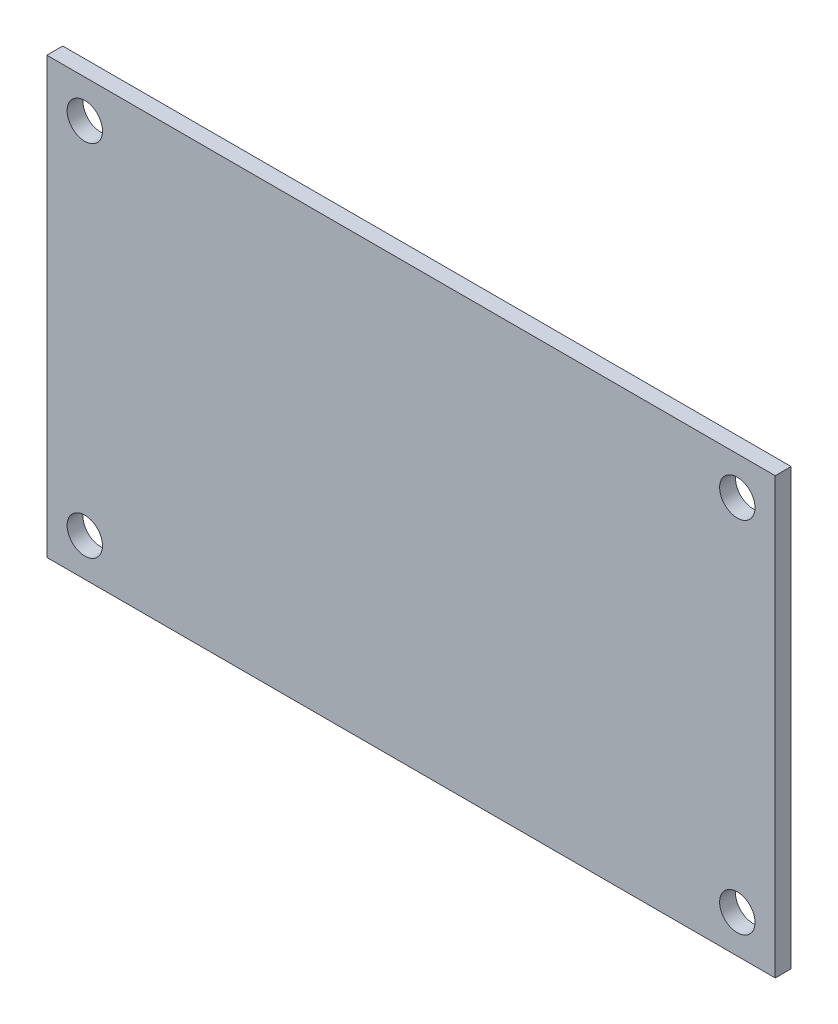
ISO-10303-21;
HEADER;
FILE_DESCRIPTION(('STEP AP214'),'2;1');
FILE_NAME('part.step','',(''),(''),'','','');
FILE_SCHEMA(('AUTOMOTIVE_DESIGN { 1 0 10303 214 1 1 1 1 }'));
ENDSEC;
DATA;
#1=APPLICATION_CONTEXT('core data for automotive mechanical design processes');
#2=APPLICATION_PROTOCOL_DEFINITION('international standard','automotive_design',2000,#1);
#3=PRODUCT_CONTEXT('',#1,'mechanical');
#4=PRODUCT('Part','Part','',(#3));
#5=PRODUCT_RELATED_PRODUCT_CATEGORY('part','',(#4));
#6=PRODUCT_DEFINITION_FORMATION('','',#4);
#7=PRODUCT_DEFINITION_CONTEXT('part definition',#1,'design');
#8=PRODUCT_DEFINITION('design','',#6,#7);
#9=PRODUCT_DEFINITION_SHAPE('','',#8);
#10=(LENGTH_UNIT() NAMED_UNIT(*) SI_UNIT(.MILLI.,.METRE.));
#11=(NAMED_UNIT(*) PLANE_ANGLE_UNIT() SI_UNIT($,.RADIAN.));
#12=(NAMED_UNIT(*) SI_UNIT($,.STERADIAN.) SOLID_ANGLE_UNIT());
#13=UNCERTAINTY_MEASURE_WITH_UNIT(LENGTH_MEASURE(1.E-05),#10,'distance_accuracy_value','');
#14=(GEOMETRIC_REPRESENTATION_CONTEXT(3) GLOBAL_UNCERTAINTY_ASSIGNED_CONTEXT((#13)) GLOBAL_UNIT_ASSIGNED_CONTEXT((#10,
#11,#12)) REPRESENTATION_CONTEXT('',''));
#15=CARTESIAN_POINT('',(0.,0.,0.));
#16=DIRECTION('',(0.,0.,1.));
#17=DIRECTION('',(1.,0.,0.));
#18=AXIS2_PLACEMENT_3D('',#15,#16,#17);
#19=CARTESIAN_POINT('',(0.,0.,1.57));
#20=DIRECTION('',(0.,0.,1.));
#21=DIRECTION('',(1.,0.,0.));
#22=AXIS2_PLACEMENT_3D('',#19,#20,#21);
#23=PLANE('',#22);
#24=CARTESIAN_POINT('',(-49.1089755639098,-18.5685492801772,1.57));
#25=DIRECTION('',(0.,0.,1.));
#26=DIRECTION('',(1.,0.,0.));
#27=AXIS2_PLACEMENT_3D('',#24,#25,#26);
#28=CIRCLE('',#27,1.75);
#29=CARTESIAN_POINT('',(-47.3589755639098,-18.5685492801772,1.57));
#30=VERTEX_POINT('',#29);
#31=EDGE_CURVE('E121',#30,#30,#28,.T.);
#32=ORIENTED_EDGE('',*,*,#31,.F.);
#33=EDGE_LOOP('',(#32));
#34=FACE_BOUND('',#33,.T.);
#35=CARTESIAN_POINT('',(-49.1089755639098,16.9314507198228,1.57));
#36=DIRECTION('',(0.,0.,1.));
#37=DIRECTION('',(1.,0.,0.));
#38=AXIS2_PLACEMENT_3D('',#35,#36,#37);
#39=CIRCLE('',#38,1.75);
#40=CARTESIAN_POINT('',(-47.3589755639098,16.9314507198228,1.57));
#41=VERTEX_POINT('',#40);
#42=EDGE_CURVE('E100',#41,#41,#39,.T.);
#43=ORIENTED_EDGE('',*,*,#42,.F.);
#44=EDGE_LOOP('',(#43));
#45=FACE_BOUND('',#44,.T.);
#46=DIRECTION('',(0.,-1.,0.));
#47=VECTOR('',#46,1.);
#48=CARTESIAN_POINT('',(-52.8589755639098,20.6814507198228,1.57));
#49=LINE('',#48,#47);
#50=CARTESIAN_POINT('',(-52.8589755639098,20.6814507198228,1.57));
#51=VERTEX_POINT('',#50);
#52=CARTESIAN_POINT('',(-52.8589755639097,-22.3185492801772,1.57));
#53=VERTEX_POINT('',#52);
#54=EDGE_CURVE('E85',#51,#53,#49,.T.);
#55=ORIENTED_EDGE('',*,*,#54,.T.);
#56=DIRECTION('',(1.,0.,0.));
#57=VECTOR('',#56,1.);
#58=CARTESIAN_POINT('',(-52.8589755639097,-22.3185492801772,1.57));
#59=LINE('',#58,#57);
#60=CARTESIAN_POINT('',(19.1410244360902,-22.3185492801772,1.57));
#61=VERTEX_POINT('',#60);
#62=EDGE_CURVE('E80',#53,#61,#59,.T.);
#63=ORIENTED_EDGE('',*,*,#62,.T.);
#64=DIRECTION('',(0.,1.,0.));
#65=VECTOR('',#64,1.);
#66=CARTESIAN_POINT('',(19.1410244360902,20.6814507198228,1.57));
#67=LINE('',#66,#65);
#68=CARTESIAN_POINT('',(19.1410244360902,20.6814507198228,1.57));
#69=VERTEX_POINT('',#68);
#70=EDGE_CURVE('E83',#61,#69,#67,.T.);
#71=ORIENTED_EDGE('',*,*,#70,.T.);
#72=DIRECTION('',(-1.,0.,0.));
#73=VECTOR('',#72,1.);
#74=CARTESIAN_POINT('',(-52.8589755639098,20.6814507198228,1.57));
#75=LINE('',#74,#73);
#76=EDGE_CURVE('E50',#69,#51,#75,.T.);
#77=ORIENTED_EDGE('',*,*,#76,.T.);
#78=EDGE_LOOP('',(#55,#63,#71,#77));
#79=FACE_BOUND('',#78,.T.);
#80=CARTESIAN_POINT('',(15.3910244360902,16.9314507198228,1.57));
#81=DIRECTION('',(0.,0.,1.));
#82=DIRECTION('',(1.,0.,0.));
#83=AXIS2_PLACEMENT_3D('',#80,#81,#82);
#84=CIRCLE('',#83,1.75);
#85=CARTESIAN_POINT('',(17.1410244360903,16.9314507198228,1.57));
#86=VERTEX_POINT('',#85);
#87=EDGE_CURVE('E115',#86,#86,#84,.T.);
#88=ORIENTED_EDGE('',*,*,#87,.F.);
#89=EDGE_LOOP('',(#88));
#90=FACE_BOUND('',#89,.T.);
#91=CARTESIAN_POINT('',(15.3910244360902,-18.5685492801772,1.57));
#92=DIRECTION('',(0.,0.,1.));
#93=DIRECTION('',(1.,0.,0.));
#94=AXIS2_PLACEMENT_3D('',#91,#92,#93);
#95=CIRCLE('',#94,1.75);
#96=CARTESIAN_POINT('',(17.1410244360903,-18.5685492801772,1.57));
#97=VERTEX_POINT('',#96);
#98=EDGE_CURVE('E127',#97,#97,#95,.T.);
#99=ORIENTED_EDGE('',*,*,#98,.F.);
#100=EDGE_LOOP('',(#99));
#101=FACE_BOUND('',#100,.T.);
#102=ADVANCED_FACE('F33',(#34,#45,#79,#90,#101),#23,.T.);
#103=CARTESIAN_POINT('',(0.,0.,0.));
#104=DIRECTION('',(0.,0.,1.));
#105=DIRECTION('',(1.,0.,0.));
#106=AXIS2_PLACEMENT_3D('',#103,#104,#105);
#107=PLANE('',#106);
#108=CARTESIAN_POINT('',(-49.1089755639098,-18.5685492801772,0.));
#109=DIRECTION('',(0.,0.,1.));
#110=DIRECTION('',(1.,0.,0.));
#111=AXIS2_PLACEMENT_3D('',#108,#109,#110);
#112=CIRCLE('',#111,1.75);
#113=CARTESIAN_POINT('',(-47.3589755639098,-18.5685492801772,0.));
#114=VERTEX_POINT('',#113);
#115=EDGE_CURVE('E124',#114,#114,#112,.T.);
#116=ORIENTED_EDGE('',*,*,#115,.T.);
#117=EDGE_LOOP('',(#116));
#118=FACE_BOUND('',#117,.T.);
#119=CARTESIAN_POINT('',(-49.1089755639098,16.9314507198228,0.));
#120=DIRECTION('',(0.,0.,1.));
#121=DIRECTION('',(1.,0.,0.));
#122=AXIS2_PLACEMENT_3D('',#119,#120,#121);
#123=CIRCLE('',#122,1.75);
#124=CARTESIAN_POINT('',(-47.3589755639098,16.9314507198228,0.));
#125=VERTEX_POINT('',#124);
#126=EDGE_CURVE('E112',#125,#125,#123,.T.);
#127=ORIENTED_EDGE('',*,*,#126,.T.);
#128=EDGE_LOOP('',(#127));
#129=FACE_BOUND('',#128,.T.);
#130=DIRECTION('',(0.,-1.,0.));
#131=VECTOR('',#130,1.);
#132=CARTESIAN_POINT('',(-52.8589755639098,20.6814507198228,0.));
#133=LINE('',#132,#131);
#134=CARTESIAN_POINT('',(-52.8589755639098,20.6814507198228,0.));
#135=VERTEX_POINT('',#134);
#136=CARTESIAN_POINT('',(-52.8589755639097,-22.3185492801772,0.));
#137=VERTEX_POINT('',#136);
#138=EDGE_CURVE('E97',#135,#137,#133,.T.);
#139=ORIENTED_EDGE('',*,*,#138,.F.);
#140=DIRECTION('',(-1.,0.,0.));
#141=VECTOR('',#140,1.);
#142=CARTESIAN_POINT('',(-52.8589755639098,20.6814507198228,0.));
#143=LINE('',#142,#141);
#144=CARTESIAN_POINT('',(19.1410244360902,20.6814507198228,0.));
#145=VERTEX_POINT('',#144);
#146=EDGE_CURVE('E73',#145,#135,#143,.T.);
#147=ORIENTED_EDGE('',*,*,#146,.F.);
#148=DIRECTION('',(0.,1.,0.));
#149=VECTOR('',#148,1.);
#150=CARTESIAN_POINT('',(19.1410244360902,20.6814507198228,0.));
#151=LINE('',#150,#149);
#152=CARTESIAN_POINT('',(19.1410244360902,-22.3185492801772,0.));
#153=VERTEX_POINT('',#152);
#154=EDGE_CURVE('E67',#153,#145,#151,.T.);
#155=ORIENTED_EDGE('',*,*,#154,.F.);
#156=DIRECTION('',(1.,0.,0.));
#157=VECTOR('',#156,1.);
#158=CARTESIAN_POINT('',(-52.8589755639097,-22.3185492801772,0.));
#159=LINE('',#158,#157);
#160=EDGE_CURVE('E89',#137,#153,#159,.T.);
#161=ORIENTED_EDGE('',*,*,#160,.F.);
#162=EDGE_LOOP('',(#139,#147,#155,#161));
#163=FACE_BOUND('',#162,.T.);
#164=CARTESIAN_POINT('',(15.3910244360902,16.9314507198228,0.));
#165=DIRECTION('',(0.,0.,1.));
#166=DIRECTION('',(1.,0.,0.));
#167=AXIS2_PLACEMENT_3D('',#164,#165,#166);
#168=CIRCLE('',#167,1.75);
#169=CARTESIAN_POINT('',(17.1410244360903,16.9314507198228,0.));
#170=VERTEX_POINT('',#169);
#171=EDGE_CURVE('E118',#170,#170,#168,.T.);
#172=ORIENTED_EDGE('',*,*,#171,.T.);
#173=EDGE_LOOP('',(#172));
#174=FACE_BOUND('',#173,.T.);
#175=CARTESIAN_POINT('',(15.3910244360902,-18.5685492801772,0.));
#176=DIRECTION('',(0.,0.,1.));
#177=DIRECTION('',(1.,0.,0.));
#178=AXIS2_PLACEMENT_3D('',#175,#176,#177);
#179=CIRCLE('',#178,1.75);
#180=CARTESIAN_POINT('',(17.1410244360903,-18.5685492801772,0.));
#181=VERTEX_POINT('',#180);
#182=EDGE_CURVE('E130',#181,#181,#179,.T.);
#183=ORIENTED_EDGE('',*,*,#182,.T.);
#184=EDGE_LOOP('',(#183));
#185=FACE_BOUND('',#184,.T.);
#186=ADVANCED_FACE('F108',(#118,#129,#163,#174,#185),#107,.F.);
#187=CARTESIAN_POINT('',(-52.8589755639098,20.6814507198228,1.57));
#188=DIRECTION('',(1.,0.,0.));
#189=DIRECTION('',(0.,1.,0.));
#190=AXIS2_PLACEMENT_3D('',#187,#188,#189);
#191=PLANE('',#190);
#192=ORIENTED_EDGE('',*,*,#138,.T.);
#193=DIRECTION('',(0.,0.,-1.));
#194=VECTOR('',#193,1.);
#195=CARTESIAN_POINT('',(-52.8589755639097,-22.3185492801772,1.57));
#196=LINE('',#195,#194);
#197=EDGE_CURVE('E11',#53,#137,#196,.T.);
#198=ORIENTED_EDGE('',*,*,#197,.F.);
#199=ORIENTED_EDGE('',*,*,#54,.F.);
#200=DIRECTION('',(0.,0.,-1.));
#201=VECTOR('',#200,1.);
#202=CARTESIAN_POINT('',(-52.8589755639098,20.6814507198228,1.57));
#203=LINE('',#202,#201);
#204=EDGE_CURVE('E93',#51,#135,#203,.T.);
#205=ORIENTED_EDGE('',*,*,#204,.T.);
#206=EDGE_LOOP('',(#192,#198,#199,#205));
#207=FACE_BOUND('',#206,.T.);
#208=ADVANCED_FACE('F35',(#207),#191,.F.);
#209=CARTESIAN_POINT('',(-52.8589755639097,-22.3185492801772,1.57));
#210=DIRECTION('',(0.,1.,0.));
#211=DIRECTION('',(0.,0.,1.));
#212=AXIS2_PLACEMENT_3D('',#209,#210,#211);
#213=PLANE('',#212);
#214=ORIENTED_EDGE('',*,*,#160,.T.);
#215=DIRECTION('',(0.,0.,-1.));
#216=VECTOR('',#215,1.);
#217=CARTESIAN_POINT('',(19.1410244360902,-22.3185492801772,1.57));
#218=LINE('',#217,#216);
#219=EDGE_CURVE('E42',#61,#153,#218,.T.);
#220=ORIENTED_EDGE('',*,*,#219,.F.);
#221=ORIENTED_EDGE('',*,*,#62,.F.);
#222=ORIENTED_EDGE('',*,*,#197,.T.);
#223=EDGE_LOOP('',(#214,#220,#221,#222));
#224=FACE_BOUND('',#223,.T.);
#225=ADVANCED_FACE('F88',(#224),#213,.F.);
#226=CARTESIAN_POINT('',(19.1410244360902,20.6814507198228,1.57));
#227=DIRECTION('',(-1.,0.,0.));
#228=DIRECTION('',(0.,-1.,0.));
#229=AXIS2_PLACEMENT_3D('',#226,#227,#228);
#230=PLANE('',#229);
#231=ORIENTED_EDGE('',*,*,#154,.T.);
#232=DIRECTION('',(0.,0.,-1.));
#233=VECTOR('',#232,1.);
#234=CARTESIAN_POINT('',(19.1410244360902,20.6814507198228,1.57));
#235=LINE('',#234,#233);
#236=EDGE_CURVE('E90',#69,#145,#235,.T.);
#237=ORIENTED_EDGE('',*,*,#236,.F.);
#238=ORIENTED_EDGE('',*,*,#70,.F.);
#239=ORIENTED_EDGE('',*,*,#219,.T.);
#240=EDGE_LOOP('',(#231,#237,#238,#239));
#241=FACE_BOUND('',#240,.T.);
#242=ADVANCED_FACE('F91',(#241),#230,.F.);
#243=CARTESIAN_POINT('',(-52.8589755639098,20.6814507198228,1.57));
#244=DIRECTION('',(0.,-1.,0.));
#245=DIRECTION('',(0.,0.,-1.));
#246=AXIS2_PLACEMENT_3D('',#243,#244,#245);
#247=PLANE('',#246);
#248=ORIENTED_EDGE('',*,*,#146,.T.);
#249=ORIENTED_EDGE('',*,*,#204,.F.);
#250=ORIENTED_EDGE('',*,*,#76,.F.);
#251=ORIENTED_EDGE('',*,*,#236,.T.);
#252=EDGE_LOOP('',(#248,#249,#250,#251));
#253=FACE_BOUND('',#252,.T.);
#254=ADVANCED_FACE('F105',(#253),#247,.F.);
#255=CARTESIAN_POINT('',(-49.1089755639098,16.9314507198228,1.57));
#256=DIRECTION('',(0.,0.,-1.));
#257=DIRECTION('',(-1.,0.,0.));
#258=AXIS2_PLACEMENT_3D('',#255,#256,#257);
#259=CYLINDRICAL_SURFACE('',#258,1.75);
#260=ORIENTED_EDGE('',*,*,#42,.T.);
#261=EDGE_LOOP('',(#260));
#262=FACE_BOUND('',#261,.T.);
#263=ORIENTED_EDGE('',*,*,#126,.F.);
#264=EDGE_LOOP('',(#263));
#265=FACE_BOUND('',#264,.T.);
#266=ADVANCED_FACE('F150',(#262,#265),#259,.F.);
#267=CARTESIAN_POINT('',(15.3910244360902,16.9314507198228,1.57));
#268=DIRECTION('',(0.,0.,-1.));
#269=DIRECTION('',(-1.,0.,0.));
#270=AXIS2_PLACEMENT_3D('',#267,#268,#269);
#271=CYLINDRICAL_SURFACE('',#270,1.75);
#272=ORIENTED_EDGE('',*,*,#87,.T.);
#273=EDGE_LOOP('',(#272));
#274=FACE_BOUND('',#273,.T.);
#275=ORIENTED_EDGE('',*,*,#171,.F.);
#276=EDGE_LOOP('',(#275));
#277=FACE_BOUND('',#276,.T.);
#278=ADVANCED_FACE('F196',(#274,#277),#271,.F.);
#279=CARTESIAN_POINT('',(-49.1089755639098,-18.5685492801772,1.57));
#280=DIRECTION('',(0.,0.,-1.));
#281=DIRECTION('',(-1.,0.,0.));
#282=AXIS2_PLACEMENT_3D('',#279,#280,#281);
#283=CYLINDRICAL_SURFACE('',#282,1.75);
#284=ORIENTED_EDGE('',*,*,#31,.T.);
#285=EDGE_LOOP('',(#284));
#286=FACE_BOUND('',#285,.T.);
#287=ORIENTED_EDGE('',*,*,#115,.F.);
#288=EDGE_LOOP('',(#287));
#289=FACE_BOUND('',#288,.T.);
#290=ADVANCED_FACE('F204',(#286,#289),#283,.F.);
#291=CARTESIAN_POINT('',(15.3910244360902,-18.5685492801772,1.57));
#292=DIRECTION('',(0.,0.,-1.));
#293=DIRECTION('',(-1.,0.,0.));
#294=AXIS2_PLACEMENT_3D('',#291,#292,#293);
#295=CYLINDRICAL_SURFACE('',#294,1.75);
#296=ORIENTED_EDGE('',*,*,#98,.T.);
#297=EDGE_LOOP('',(#296));
#298=FACE_BOUND('',#297,.T.);
#299=ORIENTED_EDGE('',*,*,#182,.F.);
#300=EDGE_LOOP('',(#299));
#301=FACE_BOUND('',#300,.T.);
#302=ADVANCED_FACE('F136',(#298,#301),#295,.F.);
#303=CLOSED_SHELL('',(#102,#186,#208,#225,#242,#254,#266,#278,#290,#302));
#304=MANIFOLD_SOLID_BREP('B2',#303);
#305=ADVANCED_BREP_SHAPE_REPRESENTATION('',(#18,#304),#14);
#306=SHAPE_DEFINITION_REPRESENTATION(#9,#305);
ENDSEC;
END-ISO-10303-21;
